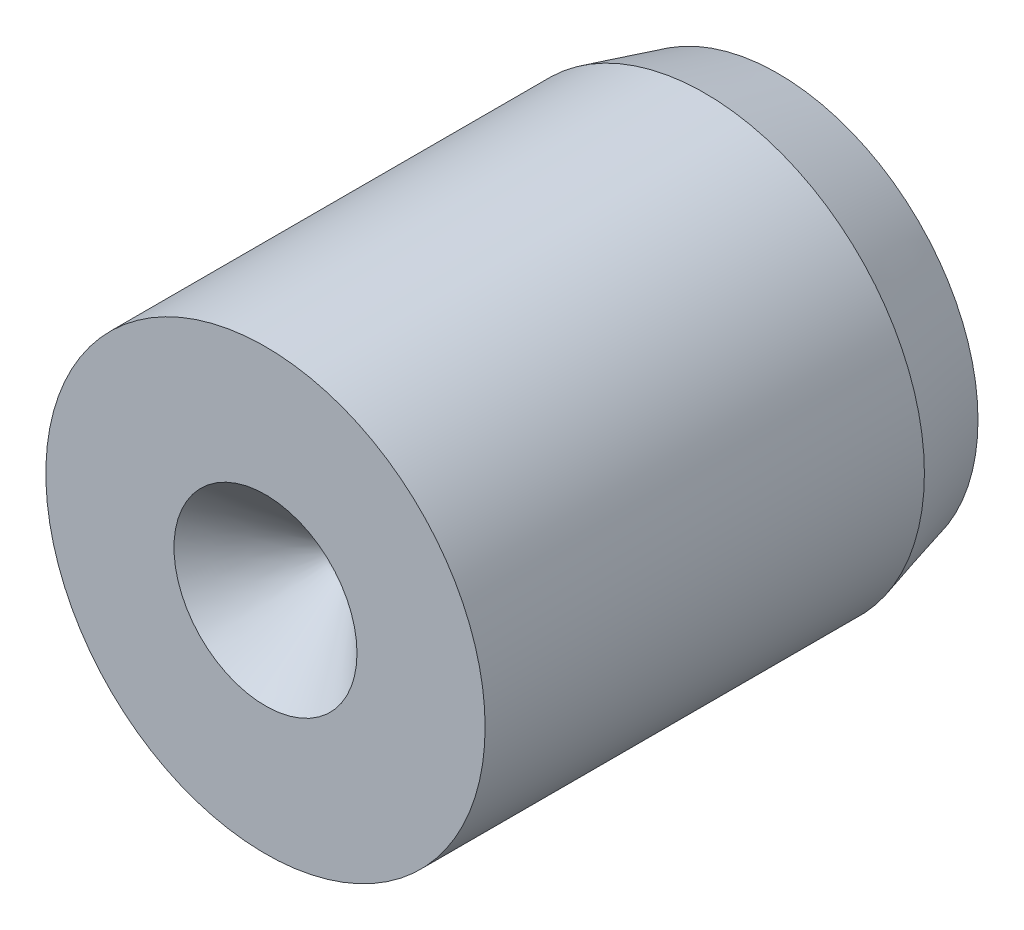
ISO-10303-21;
HEADER;
FILE_DESCRIPTION(('STEP AP214'),'2;1');
FILE_NAME('part.step','',(''),(''),'','','');
FILE_SCHEMA(('AUTOMOTIVE_DESIGN { 1 0 10303 214 1 1 1 1 }'));
ENDSEC;
DATA;
#1=APPLICATION_CONTEXT('core data for automotive mechanical design processes');
#2=APPLICATION_PROTOCOL_DEFINITION('international standard','automotive_design',2000,#1);
#3=PRODUCT_CONTEXT('',#1,'mechanical');
#4=PRODUCT('Part','Part','',(#3));
#5=PRODUCT_RELATED_PRODUCT_CATEGORY('part','',(#4));
#6=PRODUCT_DEFINITION_FORMATION('','',#4);
#7=PRODUCT_DEFINITION_CONTEXT('part definition',#1,'design');
#8=PRODUCT_DEFINITION('design','',#6,#7);
#9=PRODUCT_DEFINITION_SHAPE('','',#8);
#10=(LENGTH_UNIT() NAMED_UNIT(*) SI_UNIT(.MILLI.,.METRE.));
#11=(NAMED_UNIT(*) PLANE_ANGLE_UNIT() SI_UNIT($,.RADIAN.));
#12=(NAMED_UNIT(*) SI_UNIT($,.STERADIAN.) SOLID_ANGLE_UNIT());
#13=UNCERTAINTY_MEASURE_WITH_UNIT(LENGTH_MEASURE(1.E-05),#10,'distance_accuracy_value','');
#14=(GEOMETRIC_REPRESENTATION_CONTEXT(3) GLOBAL_UNCERTAINTY_ASSIGNED_CONTEXT((#13)) GLOBAL_UNIT_ASSIGNED_CONTEXT((#10,
#11,#12)) REPRESENTATION_CONTEXT('',''));
#15=CARTESIAN_POINT('',(0.,0.,0.));
#16=DIRECTION('',(0.,0.,1.));
#17=DIRECTION('',(1.,0.,0.));
#18=AXIS2_PLACEMENT_3D('',#15,#16,#17);
#19=CARTESIAN_POINT('',(0.,3.,7.));
#20=DIRECTION('',(0.,0.,-1.));
#21=DIRECTION('',(-1.,0.,0.));
#22=AXIS2_PLACEMENT_3D('',#19,#20,#21);
#23=PLANE('',#22);
#24=CARTESIAN_POINT('',(0.,0.,7.));
#25=DIRECTION('',(0.,0.,1.));
#26=DIRECTION('',(1.,0.,0.));
#27=AXIS2_PLACEMENT_3D('',#24,#25,#26);
#28=CIRCLE('',#27,1.25);
#29=CARTESIAN_POINT('',(1.25,0.,7.));
#30=VERTEX_POINT('',#29);
#31=EDGE_CURVE('E9',#30,#30,#28,.T.);
#32=ORIENTED_EDGE('',*,*,#31,.F.);
#33=EDGE_LOOP('',(#32));
#34=FACE_BOUND('',#33,.T.);
#35=CARTESIAN_POINT('',(0.,0.,7.));
#36=DIRECTION('',(0.,0.,1.));
#37=DIRECTION('',(1.,0.,0.));
#38=AXIS2_PLACEMENT_3D('',#35,#36,#37);
#39=CIRCLE('',#38,3.);
#40=CARTESIAN_POINT('',(3.,0.,7.));
#41=VERTEX_POINT('',#40);
#42=EDGE_CURVE('E33',#41,#41,#39,.T.);
#43=ORIENTED_EDGE('',*,*,#42,.T.);
#44=EDGE_LOOP('',(#43));
#45=FACE_BOUND('',#44,.T.);
#46=ADVANCED_FACE('F14',(#34,#45),#23,.F.);
#47=CARTESIAN_POINT('',(0.,0.,7.));
#48=DIRECTION('',(0.,0.,1.));
#49=DIRECTION('',(1.,0.,0.));
#50=AXIS2_PLACEMENT_3D('',#47,#48,#49);
#51=CONICAL_SURFACE('',#50,1.25,0.78539816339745);
#52=CARTESIAN_POINT('',(0.,0.,5.75));
#53=VERTEX_POINT('',#52);
#54=VERTEX_LOOP('',#53);
#55=FACE_BOUND('',#54,.T.);
#56=ORIENTED_EDGE('',*,*,#31,.T.);
#57=EDGE_LOOP('',(#56));
#58=FACE_BOUND('',#57,.T.);
#59=ADVANCED_FACE('F23',(#55,#58),#51,.F.);
#60=CARTESIAN_POINT('',(0.,2.73205080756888,0.));
#61=DIRECTION('',(0.,0.,-1.));
#62=DIRECTION('',(-1.,0.,0.));
#63=AXIS2_PLACEMENT_3D('',#60,#61,#62);
#64=PLANE('',#63);
#65=CARTESIAN_POINT('',(0.,0.,0.));
#66=DIRECTION('',(0.,0.,1.));
#67=DIRECTION('',(1.,0.,0.));
#68=AXIS2_PLACEMENT_3D('',#65,#66,#67);
#69=CIRCLE('',#68,2.73205080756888);
#70=CARTESIAN_POINT('',(2.73205080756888,0.,0.));
#71=VERTEX_POINT('',#70);
#72=EDGE_CURVE('E20',#71,#71,#69,.T.);
#73=ORIENTED_EDGE('',*,*,#72,.F.);
#74=EDGE_LOOP('',(#73));
#75=FACE_BOUND('',#74,.T.);
#76=ADVANCED_FACE('F26',(#75),#64,.T.);
#77=CARTESIAN_POINT('',(0.,0.,1.));
#78=DIRECTION('',(0.,0.,1.));
#79=DIRECTION('',(1.,0.,0.));
#80=AXIS2_PLACEMENT_3D('',#77,#78,#79);
#81=CONICAL_SURFACE('',#80,3.,0.26179938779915);
#82=ORIENTED_EDGE('',*,*,#72,.T.);
#83=EDGE_LOOP('',(#82));
#84=FACE_BOUND('',#83,.T.);
#85=CARTESIAN_POINT('',(0.,0.,1.));
#86=DIRECTION('',(0.,0.,1.));
#87=DIRECTION('',(1.,0.,0.));
#88=AXIS2_PLACEMENT_3D('',#85,#86,#87);
#89=CIRCLE('',#88,3.);
#90=CARTESIAN_POINT('',(3.,0.,1.));
#91=VERTEX_POINT('',#90);
#92=EDGE_CURVE('E35',#91,#91,#89,.T.);
#93=ORIENTED_EDGE('',*,*,#92,.F.);
#94=EDGE_LOOP('',(#93));
#95=FACE_BOUND('',#94,.T.);
#96=ADVANCED_FACE('F42',(#84,#95),#81,.T.);
#97=CARTESIAN_POINT('',(0.,0.,7.));
#98=DIRECTION('',(0.,0.,1.));
#99=DIRECTION('',(1.,0.,0.));
#100=AXIS2_PLACEMENT_3D('',#97,#98,#99);
#101=CYLINDRICAL_SURFACE('',#100,3.);
#102=ORIENTED_EDGE('',*,*,#92,.T.);
#103=EDGE_LOOP('',(#102));
#104=FACE_BOUND('',#103,.T.);
#105=ORIENTED_EDGE('',*,*,#42,.F.);
#106=EDGE_LOOP('',(#105));
#107=FACE_BOUND('',#106,.T.);
#108=ADVANCED_FACE('F51',(#104,#107),#101,.T.);
#109=CLOSED_SHELL('',(#46,#59,#76,#96,#108));
#110=MANIFOLD_SOLID_BREP('B1',#109);
#111=ADVANCED_BREP_SHAPE_REPRESENTATION('',(#18,#110),#14);
#112=SHAPE_DEFINITION_REPRESENTATION(#9,#111);
ENDSEC;
END-ISO-10303-21;
